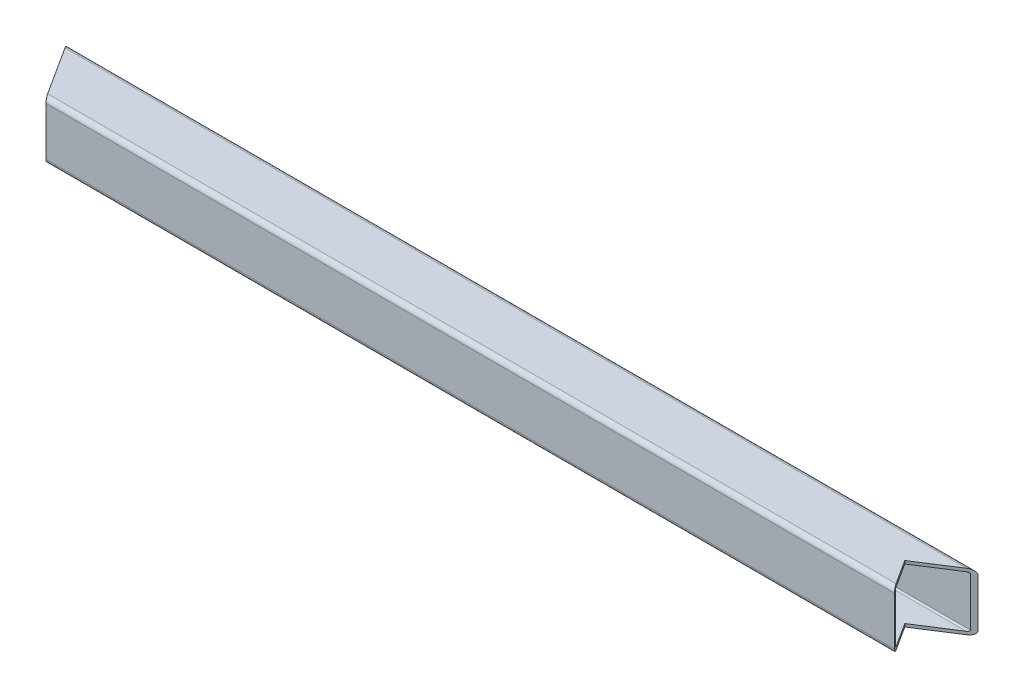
from build123d import *

# Parameters (mm, degrees)
BOSS_EXTRUDE1_DEPTH = 698.5
CUT_EXTRUDE2_DEPTH  = 38.1
CUT_EXTRUDE3_DEPTH  = 38.1


with BuildPart() as part:
    # Sketch1 → Boss-Extrude1 (new body)
    with BuildSketch(Plane(origin=(0, 0, 0), x_dir=(0, 0, -1), z_dir=(1, 0, 0))):
        with BuildLine():
            Line((0, 2.54), (0, 29.21))
            ThreePointArc((0, 29.21), (-0.743948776, 31.006051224), (-2.54, 31.75))
            Line((-2.54, 31.75), (-29.21, 31.75))
            ThreePointArc((-29.21, 31.75), (-31.006051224, 31.006051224), (-31.75, 29.21))
            Line((-31.75, 29.21), (-31.75, 2.54))
            ThreePointArc((-31.75, 2.54), (-31.006051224, 0.743948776), (-29.21, 0))
            Line((-29.21, 0), (-2.54, 0))
            ThreePointArc((-2.54, 0), (-0.743948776, 0.743948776), (0, 2.54))
        make_face()
        with BuildLine():
            Line((-1.651, 2.54), (-1.651, 29.21))
            ThreePointArc((-1.651, 29.21), (-1.911382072, 29.838617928), (-2.54, 30.099))
            Line((-2.54, 30.099), (-29.21, 30.099))
            ThreePointArc((-29.21, 30.099), (-29.838617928, 29.838617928), (-30.099, 29.21))
            Line((-30.099, 29.21), (-30.099, 2.54))
            ThreePointArc((-30.099, 2.54), (-29.838617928, 1.911382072), (-29.21, 1.651))
            Line((-29.21, 1.651), (-2.54, 1.651))
            ThreePointArc((-2.54, 1.651), (-1.911382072, 1.911382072), (-1.651, 2.54))
        make_face(mode=Mode.SUBTRACT)
    extrude(amount=BOSS_EXTRUDE1_DEPTH)

    # Sketch2 → Cut-Extrude2 (cut)
    with BuildSketch(Plane.XZ):
        Polygon((561.520902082, 15.776980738), (563.658531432, 14.405069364), (563.924384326, 14.234447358), (582.145965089, 2.54), (698.5, 2.54), (698.5, 29.21), (570.14209355, 29.21), align=None)
        Polygon((698.5, 2.54), (582.145965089, 2.54), (680.910926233, -60.84646761), (741.276869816, 33.212095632), (621.886845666, 109.83554398), (570.14209355, 29.21), (698.5, 29.21), align=None)
    extrude(amount=-CUT_EXTRUDE2_DEPTH, mode=Mode.SUBTRACT)

    # Sketch3 → Cut-Extrude3 (cut)
    with BuildSketch(Plane.XZ):
        Polygon((98.484863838, 23.210825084), (46.971235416, -57.054596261), (-37.684801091, -2.723110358), (16.35339182, 81.47593474), (25.397734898, 95.568283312), (110.053771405, 41.236797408), align=None)
    extrude(amount=-CUT_EXTRUDE3_DEPTH, mode=Mode.SUBTRACT)


solid = part.part
